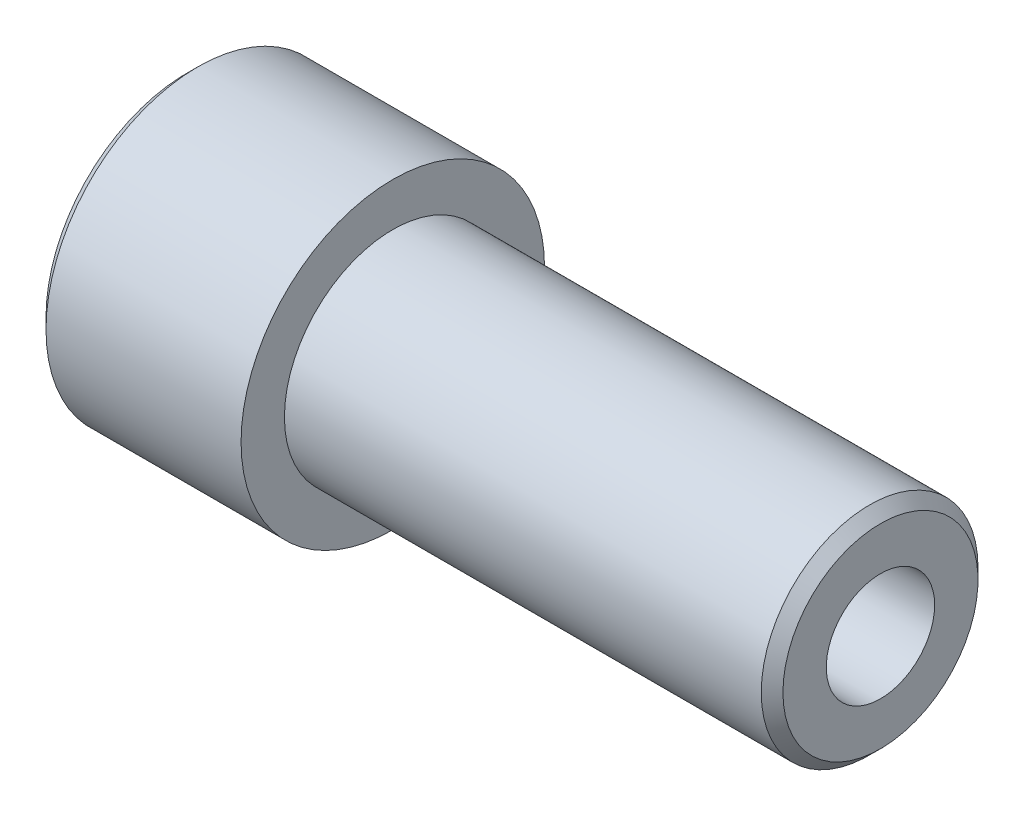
ISO-10303-21;
HEADER;
FILE_DESCRIPTION(('STEP AP214'),'2;1');
FILE_NAME('part.step','',(''),(''),'','','');
FILE_SCHEMA(('AUTOMOTIVE_DESIGN { 1 0 10303 214 1 1 1 1 }'));
ENDSEC;
DATA;
#1=APPLICATION_CONTEXT('core data for automotive mechanical design processes');
#2=APPLICATION_PROTOCOL_DEFINITION('international standard','automotive_design',2000,#1);
#3=PRODUCT_CONTEXT('',#1,'mechanical');
#4=PRODUCT('Part','Part','',(#3));
#5=PRODUCT_RELATED_PRODUCT_CATEGORY('part','',(#4));
#6=PRODUCT_DEFINITION_FORMATION('','',#4);
#7=PRODUCT_DEFINITION_CONTEXT('part definition',#1,'design');
#8=PRODUCT_DEFINITION('design','',#6,#7);
#9=PRODUCT_DEFINITION_SHAPE('','',#8);
#10=(LENGTH_UNIT() NAMED_UNIT(*) SI_UNIT(.MILLI.,.METRE.));
#11=(NAMED_UNIT(*) PLANE_ANGLE_UNIT() SI_UNIT($,.RADIAN.));
#12=(NAMED_UNIT(*) SI_UNIT($,.STERADIAN.) SOLID_ANGLE_UNIT());
#13=UNCERTAINTY_MEASURE_WITH_UNIT(LENGTH_MEASURE(1.E-05),#10,'distance_accuracy_value','');
#14=(GEOMETRIC_REPRESENTATION_CONTEXT(3) GLOBAL_UNCERTAINTY_ASSIGNED_CONTEXT((#13)) GLOBAL_UNIT_ASSIGNED_CONTEXT((#10,
#11,#12)) REPRESENTATION_CONTEXT('',''));
#15=CARTESIAN_POINT('',(0.,0.,0.));
#16=DIRECTION('',(0.,0.,1.));
#17=DIRECTION('',(1.,0.,0.));
#18=AXIS2_PLACEMENT_3D('',#15,#16,#17);
#19=CARTESIAN_POINT('',(0.,0.,0.));
#20=DIRECTION('',(1.,0.,0.));
#21=DIRECTION('',(0.,0.,-1.));
#22=AXIS2_PLACEMENT_3D('',#19,#20,#21);
#23=PLANE('',#22);
#24=CARTESIAN_POINT('',(0.,0.,0.));
#25=DIRECTION('',(1.,0.,0.));
#26=DIRECTION('',(0.,0.,-1.));
#27=AXIS2_PLACEMENT_3D('',#24,#25,#26);
#28=CIRCLE('',#27,6.5);
#29=CARTESIAN_POINT('',(0.,0.,-6.5));
#30=VERTEX_POINT('',#29);
#31=EDGE_CURVE('E46',#30,#30,#28,.F.);
#32=ORIENTED_EDGE('',*,*,#31,.T.);
#33=EDGE_LOOP('',(#32));
#34=FACE_BOUND('',#33,.T.);
#35=ADVANCED_FACE('F39',(#34),#23,.F.);
#36=CARTESIAN_POINT('',(0.,0.,0.));
#37=DIRECTION('',(-1.,0.,0.));
#38=DIRECTION('',(0.,0.,1.));
#39=AXIS2_PLACEMENT_3D('',#36,#37,#38);
#40=CYLINDRICAL_SURFACE('',#39,7.);
#41=CARTESIAN_POINT('',(0.499999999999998,0.,0.));
#42=DIRECTION('',(1.,0.,0.));
#43=DIRECTION('',(0.,0.,-1.));
#44=AXIS2_PLACEMENT_3D('',#41,#42,#43);
#45=CIRCLE('',#44,7.);
#46=CARTESIAN_POINT('',(0.499999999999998,0.,-7.));
#47=VERTEX_POINT('',#46);
#48=EDGE_CURVE('E11',#47,#47,#45,.T.);
#49=ORIENTED_EDGE('',*,*,#48,.T.);
#50=EDGE_LOOP('',(#49));
#51=FACE_BOUND('',#50,.T.);
#52=CARTESIAN_POINT('',(9.5,0.,0.));
#53=DIRECTION('',(-1.,0.,0.));
#54=DIRECTION('',(0.,0.,1.));
#55=AXIS2_PLACEMENT_3D('',#52,#53,#54);
#56=CIRCLE('',#55,7.);
#57=CARTESIAN_POINT('',(9.5,0.,7.));
#58=VERTEX_POINT('',#57);
#59=EDGE_CURVE('E63',#58,#58,#56,.T.);
#60=ORIENTED_EDGE('',*,*,#59,.T.);
#61=EDGE_LOOP('',(#60));
#62=FACE_BOUND('',#61,.T.);
#63=ADVANCED_FACE('F88',(#51,#62),#40,.T.);
#64=CARTESIAN_POINT('',(9.5,7.,0.));
#65=DIRECTION('',(-1.,0.,0.));
#66=DIRECTION('',(0.,0.,1.));
#67=AXIS2_PLACEMENT_3D('',#64,#65,#66);
#68=PLANE('',#67);
#69=ORIENTED_EDGE('',*,*,#59,.F.);
#70=EDGE_LOOP('',(#69));
#71=FACE_BOUND('',#70,.T.);
#72=CARTESIAN_POINT('',(9.5,0.,0.));
#73=DIRECTION('',(-1.,0.,0.));
#74=DIRECTION('',(0.,0.,1.));
#75=AXIS2_PLACEMENT_3D('',#72,#73,#74);
#76=CIRCLE('',#75,5.);
#77=CARTESIAN_POINT('',(9.5,0.,5.));
#78=VERTEX_POINT('',#77);
#79=EDGE_CURVE('E59',#78,#78,#76,.T.);
#80=ORIENTED_EDGE('',*,*,#79,.T.);
#81=EDGE_LOOP('',(#80));
#82=FACE_BOUND('',#81,.T.);
#83=ADVANCED_FACE('F93',(#71,#82),#68,.F.);
#84=CARTESIAN_POINT('',(0.,0.,0.));
#85=DIRECTION('',(-1.,0.,0.));
#86=DIRECTION('',(0.,0.,1.));
#87=AXIS2_PLACEMENT_3D('',#84,#85,#86);
#88=CYLINDRICAL_SURFACE('',#87,5.);
#89=CARTESIAN_POINT('',(31.5,0.,0.));
#90=DIRECTION('',(-1.,0.,0.));
#91=DIRECTION('',(0.,0.,1.));
#92=AXIS2_PLACEMENT_3D('',#89,#90,#91);
#93=CIRCLE('',#92,5.);
#94=CARTESIAN_POINT('',(31.5,0.,5.));
#95=VERTEX_POINT('',#94);
#96=EDGE_CURVE('E70',#95,#95,#93,.T.);
#97=ORIENTED_EDGE('',*,*,#96,.T.);
#98=EDGE_LOOP('',(#97));
#99=FACE_BOUND('',#98,.T.);
#100=ORIENTED_EDGE('',*,*,#79,.F.);
#101=EDGE_LOOP('',(#100));
#102=FACE_BOUND('',#101,.T.);
#103=ADVANCED_FACE('F99',(#99,#102),#88,.T.);
#104=CARTESIAN_POINT('',(32.,5.,0.));
#105=DIRECTION('',(-1.,0.,0.));
#106=DIRECTION('',(0.,0.,1.));
#107=AXIS2_PLACEMENT_3D('',#104,#105,#106);
#108=PLANE('',#107);
#109=CARTESIAN_POINT('',(32.,0.,0.));
#110=DIRECTION('',(-1.,0.,0.));
#111=DIRECTION('',(0.,0.,1.));
#112=AXIS2_PLACEMENT_3D('',#109,#110,#111);
#113=CIRCLE('',#112,4.50000000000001);
#114=CARTESIAN_POINT('',(32.,0.,4.50000000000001));
#115=VERTEX_POINT('',#114);
#116=EDGE_CURVE('E73',#115,#115,#113,.F.);
#117=ORIENTED_EDGE('',*,*,#116,.T.);
#118=EDGE_LOOP('',(#117));
#119=FACE_BOUND('',#118,.T.);
#120=CARTESIAN_POINT('',(32.,0.,0.));
#121=DIRECTION('',(1.,0.,0.));
#122=DIRECTION('',(0.,0.,-1.));
#123=AXIS2_PLACEMENT_3D('',#120,#121,#122);
#124=CIRCLE('',#123,2.5);
#125=CARTESIAN_POINT('',(32.,0.,-2.5));
#126=VERTEX_POINT('',#125);
#127=EDGE_CURVE('E60',#126,#126,#124,.T.);
#128=ORIENTED_EDGE('',*,*,#127,.F.);
#129=EDGE_LOOP('',(#128));
#130=FACE_BOUND('',#129,.T.);
#131=ADVANCED_FACE('F53',(#119,#130),#108,.F.);
#132=CARTESIAN_POINT('',(12.,0.,0.));
#133=DIRECTION('',(1.,0.,0.));
#134=DIRECTION('',(0.,0.,-1.));
#135=AXIS2_PLACEMENT_3D('',#132,#133,#134);
#136=CONICAL_SURFACE('',#135,2.49999999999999,1.02974425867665);
#137=CARTESIAN_POINT('',(10.4978484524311,0.,0.));
#138=VERTEX_POINT('',#137);
#139=VERTEX_LOOP('',#138);
#140=FACE_BOUND('',#139,.T.);
#141=CARTESIAN_POINT('',(12.,0.,0.));
#142=DIRECTION('',(1.,0.,0.));
#143=DIRECTION('',(0.,0.,-1.));
#144=AXIS2_PLACEMENT_3D('',#141,#142,#143);
#145=CIRCLE('',#144,2.49999999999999);
#146=CARTESIAN_POINT('',(12.,0.,-2.49999999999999));
#147=VERTEX_POINT('',#146);
#148=EDGE_CURVE('E57',#147,#147,#145,.T.);
#149=ORIENTED_EDGE('',*,*,#148,.T.);
#150=EDGE_LOOP('',(#149));
#151=FACE_BOUND('',#150,.T.);
#152=ADVANCED_FACE('F49',(#140,#151),#136,.F.);
#153=CARTESIAN_POINT('',(32.,0.,0.));
#154=DIRECTION('',(1.,0.,0.));
#155=DIRECTION('',(0.,0.,-1.));
#156=AXIS2_PLACEMENT_3D('',#153,#154,#155);
#157=CYLINDRICAL_SURFACE('',#156,2.5);
#158=ORIENTED_EDGE('',*,*,#148,.F.);
#159=EDGE_LOOP('',(#158));
#160=FACE_BOUND('',#159,.T.);
#161=ORIENTED_EDGE('',*,*,#127,.T.);
#162=EDGE_LOOP('',(#161));
#163=FACE_BOUND('',#162,.T.);
#164=ADVANCED_FACE('F52',(#160,#163),#157,.F.);
#165=CARTESIAN_POINT('',(31.5,0.,0.));
#166=DIRECTION('',(-1.,0.,0.));
#167=DIRECTION('',(0.,0.,1.));
#168=AXIS2_PLACEMENT_3D('',#165,#166,#167);
#169=CONICAL_SURFACE('',#168,5.,0.785398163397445);
#170=ORIENTED_EDGE('',*,*,#116,.F.);
#171=EDGE_LOOP('',(#170));
#172=FACE_BOUND('',#171,.T.);
#173=ORIENTED_EDGE('',*,*,#96,.F.);
#174=EDGE_LOOP('',(#173));
#175=FACE_BOUND('',#174,.T.);
#176=ADVANCED_FACE('F80',(#172,#175),#169,.T.);
#177=CARTESIAN_POINT('',(0.,0.,0.));
#178=DIRECTION('',(1.,0.,0.));
#179=DIRECTION('',(0.,0.,-1.));
#180=AXIS2_PLACEMENT_3D('',#177,#178,#179);
#181=CONICAL_SURFACE('',#180,6.5,0.785398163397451);
#182=ORIENTED_EDGE('',*,*,#48,.F.);
#183=EDGE_LOOP('',(#182));
#184=FACE_BOUND('',#183,.T.);
#185=ORIENTED_EDGE('',*,*,#31,.F.);
#186=EDGE_LOOP('',(#185));
#187=FACE_BOUND('',#186,.T.);
#188=ADVANCED_FACE('F41',(#184,#187),#181,.T.);
#189=CLOSED_SHELL('',(#35,#63,#83,#103,#131,#152,#164,#176,#188));
#190=MANIFOLD_SOLID_BREP('B2',#189);
#191=ADVANCED_BREP_SHAPE_REPRESENTATION('',(#18,#190),#14);
#192=SHAPE_DEFINITION_REPRESENTATION(#9,#191);
ENDSEC;
END-ISO-10303-21;
